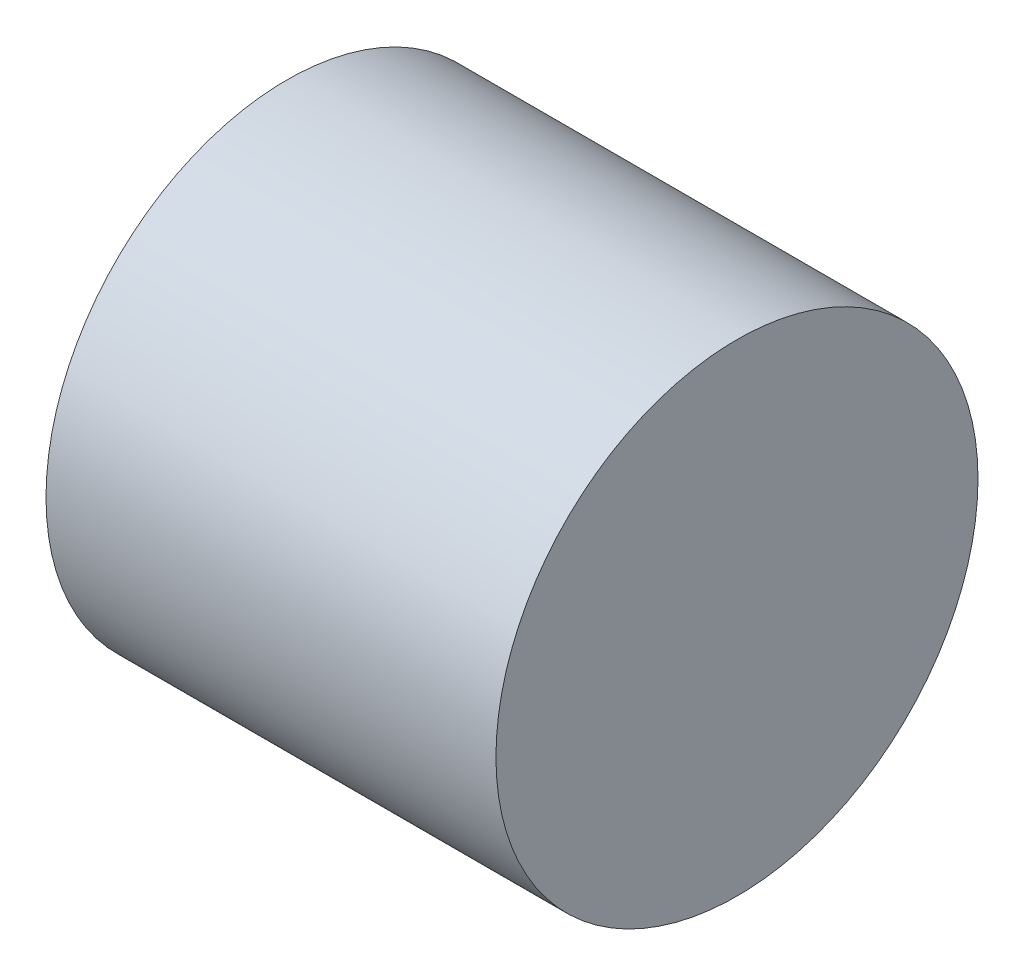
from build123d import *

# Parameters (mm, degrees)
SKETCH1_W                    = 14
SKETCH1_H                    = 7.5
F_8_0_8_DIAMETER_HOLE1_D     = 8
F_8_0_8_DIAMETER_HOLE1_DEPTH = 10
F_8_0_8_DIAMETER_HOLE1_TIP   = 2.309401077


with BuildPart() as part:
    # Sketch1 → Revolve1 (revolve)
    with BuildSketch(Plane.XY, mode=Mode.PRIVATE) as revolve1_sk:
        with Locations((7, 3.75)):
            Rectangle(SKETCH1_W, SKETCH1_H)
    revolve(revolve1_sk.sketch.rotate(Axis((0, 0, 0), (1, 0, 0)), 90), axis=Axis((0, 0, 0), (1, 0, 0)))

    # 8.0 _8_ Diameter Hole1
    with Locations(Plane(origin=(0, 0, 0), x_dir=(0, 0, -1), z_dir=(-1, 0, 0))):
        with Locations((0, 0)):
            Hole(F_8_0_8_DIAMETER_HOLE1_D / 2, depth=F_8_0_8_DIAMETER_HOLE1_DEPTH)
            with Locations((0, 0, -(F_8_0_8_DIAMETER_HOLE1_DEPTH + F_8_0_8_DIAMETER_HOLE1_TIP / 2))):  # 120° drill point
                Cone(0, F_8_0_8_DIAMETER_HOLE1_D / 2, F_8_0_8_DIAMETER_HOLE1_TIP, mode=Mode.SUBTRACT)


solid = part.part
